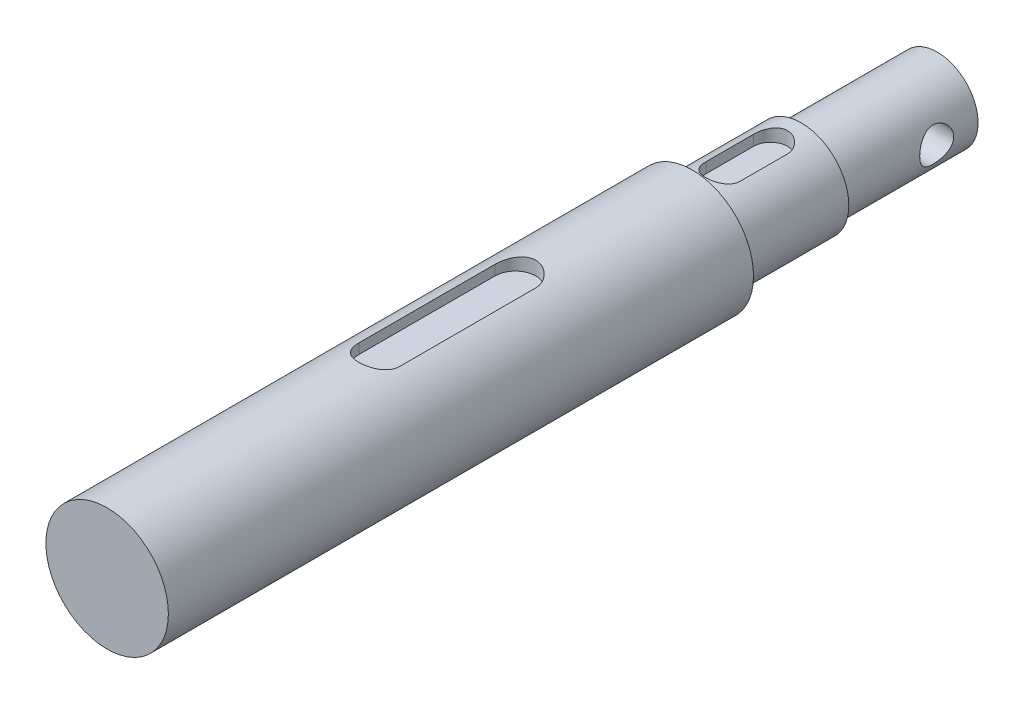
from build123d import *

# Parameters (mm, degrees)
EXTRUDE_1_DEPTH          = 4
EXTRUDE_1_DEPTH_BACK     = 82
SKETCH_1_R               = 9
SKETCH_2_R               = 7
EXTRUDE_2_DEPTH          = 16
CUT_EXTRUDE_1_DEPTH      = 101.211027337
CUT_EXTRUDE_2_DEPTH      = 100.91121061
SKETCH_5_R               = 6
EXTRUDE_3_DEPTH          = 20
CUT_EXTRUDE_3_DEPTH      = 120.110243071
CUT_EXTRUDE_3_DEPTH_BACK = 120.110243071
SKETCH_6_R               = 2.5


with BuildPart() as part:
    # Sketch 1 → Extrude 1 (new, two sides: drawn at the far end of the back side and taken through both)
    with BuildSketch(Plane.XY.offset(-EXTRUDE_1_DEPTH_BACK)):
        with Locations((-4.5, 0)):
            Circle(SKETCH_1_R)
    extrude(amount=EXTRUDE_1_DEPTH + EXTRUDE_1_DEPTH_BACK)

    # Sketch 2 → Extrude 2 (add)
    with BuildSketch(Plane(origin=(0, 0, -82), x_dir=(-1, 0, 0), z_dir=(0, 0, -1))):
        with Locations(Location((4.5, 0, 0), (0, 0, 180))):
            Circle(SKETCH_2_R)
    extrude(amount=EXTRUDE_2_DEPTH)

    # Sketch 3 → Cut-Extrude 1 (cut, through all)
    with BuildSketch(Plane(origin=(0, 7, 0), x_dir=(-1, 0, 0), z_dir=(0, 1, 0))):
        with BuildLine():
            Line((1.5, -36), (1.5, -56))
            ThreePointArc((1.5, -56), (4.5, -59), (7.5, -56))
            Line((7.5, -56), (7.5, -36))
            ThreePointArc((7.5, -36), (4.5, -33), (1.5, -36))
        make_face()
    extrude(amount=CUT_EXTRUDE_1_DEPTH, mode=Mode.SUBTRACT)

    # Sketch 4 → Cut-Extrude 2 (cut, through all)
    with BuildSketch(Plane(origin=(0, 5, 0), x_dir=(-1, 0, 0), z_dir=(0, 1, 0))):
        with BuildLine():
            Line((2, -86.5), (2, -93.5))
            ThreePointArc((2, -93.5), (4.5, -96), (7, -93.5))
            Line((7, -93.5), (7, -86.5))
            ThreePointArc((7, -86.5), (4.5, -84), (2, -86.5))
        make_face()
    extrude(amount=CUT_EXTRUDE_2_DEPTH, mode=Mode.SUBTRACT)

    # Sketch 5 → Extrude 3 (add)
    with BuildSketch(Plane(origin=(0, 0, -98), x_dir=(-1, 0, 0), z_dir=(0, 0, -1))):
        with Locations((4.5, 0)):
            Circle(SKETCH_5_R)
    extrude(amount=EXTRUDE_3_DEPTH)

    # Sketch 6 → Cut-Extrude 3 (cut, two sides: drawn at the far end of the back side and taken through both)
    with BuildSketch(Plane.ZY.offset(-CUT_EXTRUDE_3_DEPTH_BACK)):
        with Locations(Location((-111.925, 0, 0), (0, 0, 180.000000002))):
            Circle(SKETCH_6_R)
    extrude(amount=CUT_EXTRUDE_3_DEPTH + CUT_EXTRUDE_3_DEPTH_BACK, mode=Mode.SUBTRACT)


solid = part.part
